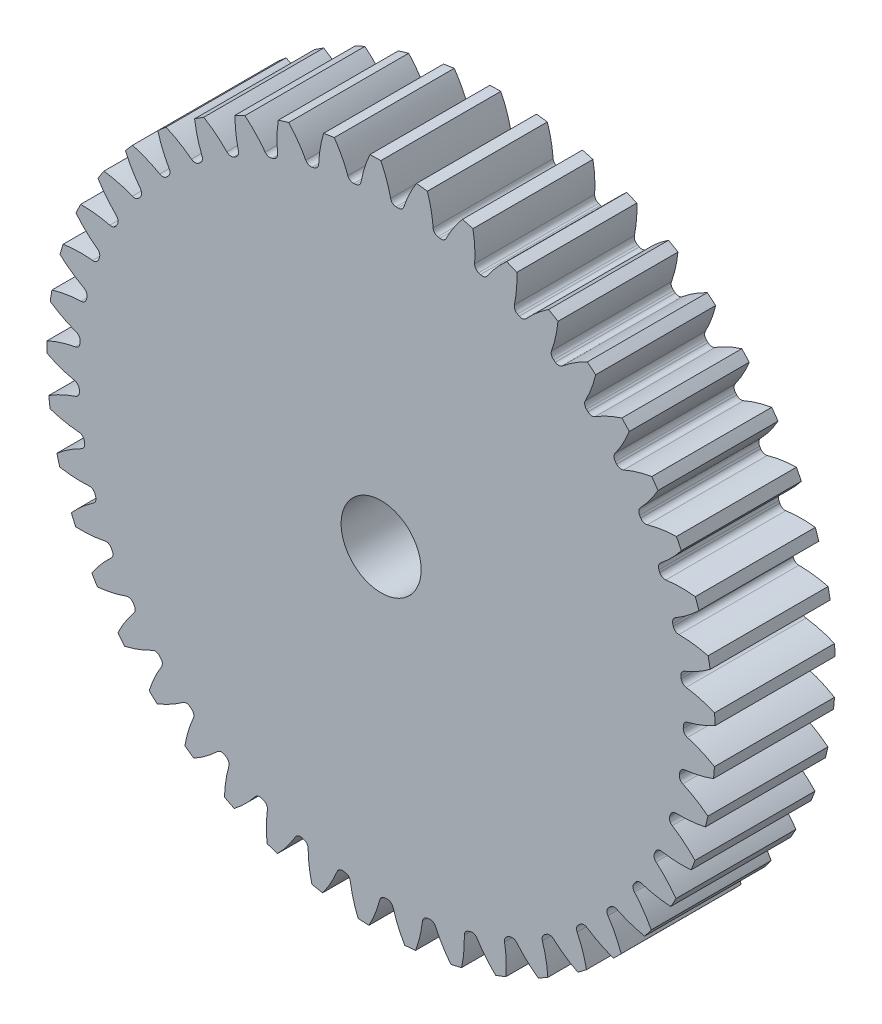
from build123d import *

# Parameters (mm, degrees)
SKETCH3_R         = 265.288888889
GEARBODY_DEPTH    = 95.25
TOOTHCUT_DEPTH    = 388.077449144
CIRPATTERN1_COUNT = 45
BOREDIA_R         = 31.75
BORE_DEPTH        = 12700


with BuildPart() as part:
    # Sketch3 → gearBody (new body)
    with BuildSketch(Plane.XY):
        Circle(SKETCH3_R)
    extrude(amount=GEARBODY_DEPTH)

    # Sketch2 → toothCut (cut, through all)
    with BuildSketch(Plane.XY):
        with BuildLine():
            ThreePointArc((239.835374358, -5.066775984), (239.851324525, -4.24513084), (239.86445985, -3.423435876))
            ThreePointArc((239.86445985, -3.423435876), (240.854000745, -0.639929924), (243.333698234, 0.965746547))
            ThreePointArc((243.333698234, 0.965746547), (254.585127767, 4.579495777), (265.288888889, 9.587823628))
            ThreePointArc((265.288888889, 9.587823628), (265.420520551, -4.69768028), (264.783451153, -18.969578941))
            ThreePointArc((264.783451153, -18.969578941), (254.263623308, -13.58561459), (243.147120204, -9.575975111))
            ThreePointArc((243.147120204, -9.575975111), (240.72579575, -7.883555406), (239.835374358, -5.066775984))
        make_face()
    toothcut = extrude(amount=TOOTHCUT_DEPTH, mode=Mode.SUBTRACT)

    # CirPattern1: toothCut ×45 about axis
    cirpattern1_axis = Axis((0, 0, 0), (0, 0, 1))
    for i in range(1, CIRPATTERN1_COUNT):
        add(toothcut.rotate(cirpattern1_axis, i * 360 / CIRPATTERN1_COUNT), mode=Mode.SUBTRACT)

    # boreDia → bore (cut, symmetric)
    with BuildSketch(Plane.XY):
        Circle(BOREDIA_R)
    extrude(amount=BORE_DEPTH, both=True, mode=Mode.SUBTRACT)


solid = part.part
